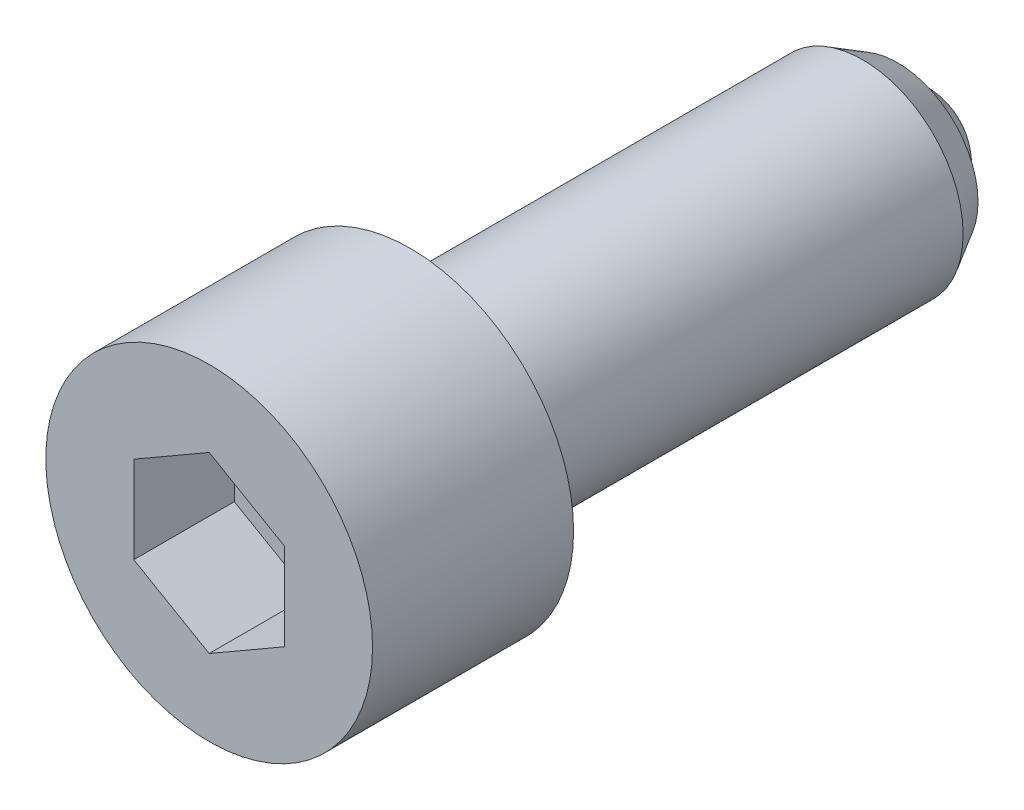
ISO-10303-21;
HEADER;
FILE_DESCRIPTION(('STEP AP214'),'2;1');
FILE_NAME('part.step','',(''),(''),'','','');
FILE_SCHEMA(('AUTOMOTIVE_DESIGN { 1 0 10303 214 1 1 1 1 }'));
ENDSEC;
DATA;
#1=APPLICATION_CONTEXT('core data for automotive mechanical design processes');
#2=APPLICATION_PROTOCOL_DEFINITION('international standard','automotive_design',2000,#1);
#3=PRODUCT_CONTEXT('',#1,'mechanical');
#4=PRODUCT('Part','Part','',(#3));
#5=PRODUCT_RELATED_PRODUCT_CATEGORY('part','',(#4));
#6=PRODUCT_DEFINITION_FORMATION('','',#4);
#7=PRODUCT_DEFINITION_CONTEXT('part definition',#1,'design');
#8=PRODUCT_DEFINITION('design','',#6,#7);
#9=PRODUCT_DEFINITION_SHAPE('','',#8);
#10=(LENGTH_UNIT() NAMED_UNIT(*) SI_UNIT(.MILLI.,.METRE.));
#11=(NAMED_UNIT(*) PLANE_ANGLE_UNIT() SI_UNIT($,.RADIAN.));
#12=(NAMED_UNIT(*) SI_UNIT($,.STERADIAN.) SOLID_ANGLE_UNIT());
#13=UNCERTAINTY_MEASURE_WITH_UNIT(LENGTH_MEASURE(1.E-05),#10,'distance_accuracy_value','');
#14=(GEOMETRIC_REPRESENTATION_CONTEXT(3) GLOBAL_UNCERTAINTY_ASSIGNED_CONTEXT((#13)) GLOBAL_UNIT_ASSIGNED_CONTEXT((#10,
#11,#12)) REPRESENTATION_CONTEXT('',''));
#15=CARTESIAN_POINT('',(0.,0.,0.));
#16=DIRECTION('',(0.,0.,1.));
#17=DIRECTION('',(1.,0.,0.));
#18=AXIS2_PLACEMENT_3D('',#15,#16,#17);
#19=CARTESIAN_POINT('',(-0.0954608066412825,0.,2.74834263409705));
#20=DIRECTION('',(0.,1.,0.));
#21=DIRECTION('',(1.,0.,0.));
#22=AXIS2_PLACEMENT_3D('',#19,#20,#21);
#23=CIRCLE('',#22,2.75);
#24=TRIMMED_CURVE('',#23,(PARAMETER_VALUE(-1.53607633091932)),
(PARAMETER_VALUE(1.53607633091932)),.T.,.PARAMETER.);
#25=CARTESIAN_POINT('',(0.,0.,2.74834263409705));
#26=DIRECTION('',(0.,0.,-1.));
#27=AXIS1_PLACEMENT('',#25,#26);
#28=SURFACE_OF_REVOLUTION('',#24,#27);
#29=CARTESIAN_POINT('',(0.,0.,1.9));
#30=DIRECTION('',(0.,0.,-1.));
#31=DIRECTION('',(1.,0.,0.));
#32=AXIS2_PLACEMENT_3D('',#29,#30,#31);
#33=CIRCLE('',#32,2.5204166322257);
#34=CARTESIAN_POINT('',(2.5204166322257,0.,1.9));
#35=VERTEX_POINT('',#34);
#36=EDGE_CURVE('E9',#35,#35,#33,.T.);
#37=ORIENTED_EDGE('',*,*,#36,.T.);
#38=EDGE_LOOP('',(#37));
#39=FACE_BOUND('',#38,.T.);
#40=CARTESIAN_POINT('',(0.,0.,0.));
#41=VERTEX_POINT('',#40);
#42=VERTEX_LOOP('',#41);
#43=FACE_BOUND('',#42,.T.);
#44=ADVANCED_FACE('F15',(#39,#43),#28,.T.);
#45=CARTESIAN_POINT('',(3.19170962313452,0.,1.9));
#46=DIRECTION('',(0.,0.,1.));
#47=DIRECTION('',(-1.,0.,0.));
#48=AXIS2_PLACEMENT_3D('',#45,#46,#47);
#49=PLANE('',#48);
#50=ORIENTED_EDGE('',*,*,#36,.F.);
#51=EDGE_LOOP('',(#50));
#52=FACE_BOUND('',#51,.T.);
#53=CARTESIAN_POINT('',(0.,0.,1.9));
#54=DIRECTION('',(0.,0.,-1.));
#55=DIRECTION('',(1.,0.,0.));
#56=AXIS2_PLACEMENT_3D('',#53,#54,#55);
#57=CIRCLE('',#56,3.19170962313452);
#58=CARTESIAN_POINT('',(3.19170962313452,0.,1.9));
#59=VERTEX_POINT('',#58);
#60=EDGE_CURVE('E22',#59,#59,#57,.T.);
#61=ORIENTED_EDGE('',*,*,#60,.T.);
#62=EDGE_LOOP('',(#61));
#63=FACE_BOUND('',#62,.T.);
#64=ADVANCED_FACE('F137',(#52,#63),#49,.F.);
#65=CARTESIAN_POINT('',(0.,0.,3.3));
#66=DIRECTION('',(0.,0.,1.));
#67=DIRECTION('',(-1.,0.,0.));
#68=AXIS2_PLACEMENT_3D('',#65,#66,#67);
#69=CONICAL_SURFACE('',#68,4.,0.523598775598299);
#70=ORIENTED_EDGE('',*,*,#60,.F.);
#71=EDGE_LOOP('',(#70));
#72=FACE_BOUND('',#71,.T.);
#73=CARTESIAN_POINT('',(0.,0.,3.3));
#74=DIRECTION('',(0.,0.,-1.));
#75=DIRECTION('',(1.,0.,0.));
#76=AXIS2_PLACEMENT_3D('',#73,#74,#75);
#77=CIRCLE('',#76,4.);
#78=CARTESIAN_POINT('',(4.,0.,3.3));
#79=VERTEX_POINT('',#78);
#80=EDGE_CURVE('E132',#79,#79,#77,.T.);
#81=ORIENTED_EDGE('',*,*,#80,.T.);
#82=EDGE_LOOP('',(#81));
#83=FACE_BOUND('',#82,.T.);
#84=ADVANCED_FACE('F139',(#72,#83),#69,.T.);
#85=CARTESIAN_POINT('',(0.,0.,1.3));
#86=DIRECTION('',(0.,0.,-1.));
#87=DIRECTION('',(1.,0.,0.));
#88=AXIS2_PLACEMENT_3D('',#85,#86,#87);
#89=CYLINDRICAL_SURFACE('',#88,4.);
#90=ORIENTED_EDGE('',*,*,#80,.F.);
#91=EDGE_LOOP('',(#90));
#92=FACE_BOUND('',#91,.T.);
#93=CARTESIAN_POINT('',(0.,0.,21.3));
#94=DIRECTION('',(0.,0.,-1.));
#95=DIRECTION('',(1.,0.,0.));
#96=AXIS2_PLACEMENT_3D('',#93,#94,#95);
#97=CIRCLE('',#96,4.);
#98=CARTESIAN_POINT('',(4.,0.,21.3));
#99=VERTEX_POINT('',#98);
#100=EDGE_CURVE('E129',#99,#99,#97,.T.);
#101=ORIENTED_EDGE('',*,*,#100,.T.);
#102=EDGE_LOOP('',(#101));
#103=FACE_BOUND('',#102,.T.);
#104=ADVANCED_FACE('F142',(#92,#103),#89,.T.);
#105=CARTESIAN_POINT('',(4.,0.,21.3));
#106=DIRECTION('',(0.,0.,-1.));
#107=DIRECTION('',(1.,0.,0.));
#108=AXIS2_PLACEMENT_3D('',#105,#106,#107);
#109=PLANE('',#108);
#110=CARTESIAN_POINT('',(0.,0.,21.3));
#111=DIRECTION('',(0.,0.,-1.));
#112=DIRECTION('',(1.,0.,0.));
#113=AXIS2_PLACEMENT_3D('',#110,#111,#112);
#114=CIRCLE('',#113,6.5);
#115=CARTESIAN_POINT('',(6.5,0.,21.3));
#116=VERTEX_POINT('',#115);
#117=EDGE_CURVE('E126',#116,#116,#114,.T.);
#118=ORIENTED_EDGE('',*,*,#117,.T.);
#119=EDGE_LOOP('',(#118));
#120=FACE_BOUND('',#119,.T.);
#121=ORIENTED_EDGE('',*,*,#100,.F.);
#122=EDGE_LOOP('',(#121));
#123=FACE_BOUND('',#122,.T.);
#124=ADVANCED_FACE('F148',(#120,#123),#109,.T.);
#125=CARTESIAN_POINT('',(0.,0.,1.3));
#126=DIRECTION('',(0.,0.,-1.));
#127=DIRECTION('',(1.,0.,0.));
#128=AXIS2_PLACEMENT_3D('',#125,#126,#127);
#129=CYLINDRICAL_SURFACE('',#128,6.5);
#130=CARTESIAN_POINT('',(0.,0.,29.3));
#131=DIRECTION('',(0.,0.,-1.));
#132=DIRECTION('',(1.,0.,0.));
#133=AXIS2_PLACEMENT_3D('',#130,#131,#132);
#134=CIRCLE('',#133,6.5);
#135=CARTESIAN_POINT('',(6.5,0.,29.3));
#136=VERTEX_POINT('',#135);
#137=EDGE_CURVE('E123',#136,#136,#134,.T.);
#138=ORIENTED_EDGE('',*,*,#137,.T.);
#139=EDGE_LOOP('',(#138));
#140=FACE_BOUND('',#139,.T.);
#141=ORIENTED_EDGE('',*,*,#117,.F.);
#142=EDGE_LOOP('',(#141));
#143=FACE_BOUND('',#142,.T.);
#144=ADVANCED_FACE('F153',(#140,#143),#129,.T.);
#145=CARTESIAN_POINT('',(6.5,0.,29.3));
#146=DIRECTION('',(0.,0.,1.));
#147=DIRECTION('',(-1.,0.,0.));
#148=AXIS2_PLACEMENT_3D('',#145,#146,#147);
#149=PLANE('',#148);
#150=DIRECTION('',(-0.86602540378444,0.5,0.));
#151=VECTOR('',#150,1.);
#152=CARTESIAN_POINT('',(3.,1.73205080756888,29.3));
#153=LINE('',#152,#151);
#154=CARTESIAN_POINT('',(3.,1.73205080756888,29.3));
#155=VERTEX_POINT('',#154);
#156=CARTESIAN_POINT('',(0.,3.46410161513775,29.3));
#157=VERTEX_POINT('',#156);
#158=EDGE_CURVE('E29',#155,#157,#153,.T.);
#159=ORIENTED_EDGE('',*,*,#158,.F.);
#160=DIRECTION('',(0.,1.,0.));
#161=VECTOR('',#160,1.);
#162=CARTESIAN_POINT('',(3.,-1.73205080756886,29.3));
#163=LINE('',#162,#161);
#164=CARTESIAN_POINT('',(3.,-1.73205080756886,29.3));
#165=VERTEX_POINT('',#164);
#166=EDGE_CURVE('E97',#165,#155,#163,.T.);
#167=ORIENTED_EDGE('',*,*,#166,.F.);
#168=DIRECTION('',(-0.866025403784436,-0.5,0.));
#169=VECTOR('',#168,1.);
#170=CARTESIAN_POINT('',(3.,-1.73205080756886,29.3));
#171=LINE('',#170,#169);
#172=CARTESIAN_POINT('',(0.,-3.46410161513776,29.3));
#173=VERTEX_POINT('',#172);
#174=EDGE_CURVE('E92',#165,#173,#171,.T.);
#175=ORIENTED_EDGE('',*,*,#174,.T.);
#176=DIRECTION('',(0.866025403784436,-0.5,0.));
#177=VECTOR('',#176,1.);
#178=CARTESIAN_POINT('',(-3.,-1.73205080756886,29.3));
#179=LINE('',#178,#177);
#180=CARTESIAN_POINT('',(-3.,-1.73205080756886,29.3));
#181=VERTEX_POINT('',#180);
#182=EDGE_CURVE('E90',#181,#173,#179,.T.);
#183=ORIENTED_EDGE('',*,*,#182,.F.);
#184=DIRECTION('',(0.,1.,0.));
#185=VECTOR('',#184,1.);
#186=CARTESIAN_POINT('',(-3.,-1.73205080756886,29.3));
#187=LINE('',#186,#185);
#188=CARTESIAN_POINT('',(-3.,1.73205080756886,29.3));
#189=VERTEX_POINT('',#188);
#190=EDGE_CURVE('E71',#181,#189,#187,.T.);
#191=ORIENTED_EDGE('',*,*,#190,.T.);
#192=DIRECTION('',(0.866025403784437,0.5,0.));
#193=VECTOR('',#192,1.);
#194=CARTESIAN_POINT('',(-3.,1.73205080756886,29.3));
#195=LINE('',#194,#193);
#196=EDGE_CURVE('E82',#189,#157,#195,.T.);
#197=ORIENTED_EDGE('',*,*,#196,.T.);
#198=EDGE_LOOP('',(#159,#167,#175,#183,#191,#197));
#199=FACE_BOUND('',#198,.T.);
#200=ORIENTED_EDGE('',*,*,#137,.F.);
#201=EDGE_LOOP('',(#200));
#202=FACE_BOUND('',#201,.T.);
#203=ADVANCED_FACE('F86',(#199,#202),#149,.T.);
#204=CARTESIAN_POINT('',(3.,1.73205080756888,25.3));
#205=DIRECTION('',(0.5,0.86602540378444,0.));
#206=DIRECTION('',(0.86602540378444,-0.5,0.));
#207=AXIS2_PLACEMENT_3D('',#204,#205,#206);
#208=PLANE('',#207);
#209=DIRECTION('',(0.,0.,1.));
#210=VECTOR('',#209,1.);
#211=CARTESIAN_POINT('',(3.,1.73205080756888,25.3));
#212=LINE('',#211,#210);
#213=CARTESIAN_POINT('',(3.,1.73205080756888,25.3));
#214=VERTEX_POINT('',#213);
#215=EDGE_CURVE('E121',#214,#155,#212,.T.);
#216=ORIENTED_EDGE('',*,*,#215,.T.);
#217=ORIENTED_EDGE('',*,*,#158,.T.);
#218=DIRECTION('',(0.,0.,1.));
#219=VECTOR('',#218,1.);
#220=CARTESIAN_POINT('',(0.,3.46410161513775,25.3));
#221=LINE('',#220,#219);
#222=CARTESIAN_POINT('',(0.,3.46410161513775,25.3));
#223=VERTEX_POINT('',#222);
#224=EDGE_CURVE('E79',#223,#157,#221,.T.);
#225=ORIENTED_EDGE('',*,*,#224,.F.);
#226=DIRECTION('',(-0.86602540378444,0.5,0.));
#227=VECTOR('',#226,1.);
#228=CARTESIAN_POINT('',(3.,1.73205080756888,25.3));
#229=LINE('',#228,#227);
#230=EDGE_CURVE('E100',#214,#223,#229,.T.);
#231=ORIENTED_EDGE('',*,*,#230,.F.);
#232=EDGE_LOOP('',(#216,#217,#225,#231));
#233=FACE_BOUND('',#232,.T.);
#234=ADVANCED_FACE('F207',(#233),#208,.F.);
#235=CARTESIAN_POINT('',(3.,-1.73205080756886,25.3));
#236=DIRECTION('',(1.,0.,0.));
#237=DIRECTION('',(0.,-1.,0.));
#238=AXIS2_PLACEMENT_3D('',#235,#236,#237);
#239=PLANE('',#238);
#240=DIRECTION('',(0.,0.,1.));
#241=VECTOR('',#240,1.);
#242=CARTESIAN_POINT('',(3.,-1.73205080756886,25.3));
#243=LINE('',#242,#241);
#244=CARTESIAN_POINT('',(3.,-1.73205080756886,25.3));
#245=VERTEX_POINT('',#244);
#246=EDGE_CURVE('E119',#245,#165,#243,.T.);
#247=ORIENTED_EDGE('',*,*,#246,.T.);
#248=ORIENTED_EDGE('',*,*,#166,.T.);
#249=ORIENTED_EDGE('',*,*,#215,.F.);
#250=DIRECTION('',(0.,1.,0.));
#251=VECTOR('',#250,1.);
#252=CARTESIAN_POINT('',(3.,-1.73205080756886,25.3));
#253=LINE('',#252,#251);
#254=EDGE_CURVE('E112',#245,#214,#253,.T.);
#255=ORIENTED_EDGE('',*,*,#254,.F.);
#256=EDGE_LOOP('',(#247,#248,#249,#255));
#257=FACE_BOUND('',#256,.T.);
#258=ADVANCED_FACE('F216',(#257),#239,.F.);
#259=CARTESIAN_POINT('',(3.,-1.73205080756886,25.3));
#260=DIRECTION('',(-0.5,0.866025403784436,0.));
#261=DIRECTION('',(0.866025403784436,0.5,0.));
#262=AXIS2_PLACEMENT_3D('',#259,#260,#261);
#263=PLANE('',#262);
#264=DIRECTION('',(0.,0.,1.));
#265=VECTOR('',#264,1.);
#266=CARTESIAN_POINT('',(0.,-3.46410161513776,25.3));
#267=LINE('',#266,#265);
#268=CARTESIAN_POINT('',(0.,-3.46410161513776,25.3));
#269=VERTEX_POINT('',#268);
#270=EDGE_CURVE('E117',#269,#173,#267,.T.);
#271=ORIENTED_EDGE('',*,*,#270,.T.);
#272=ORIENTED_EDGE('',*,*,#174,.F.);
#273=ORIENTED_EDGE('',*,*,#246,.F.);
#274=DIRECTION('',(-0.866025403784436,-0.5,0.));
#275=VECTOR('',#274,1.);
#276=CARTESIAN_POINT('',(3.,-1.73205080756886,25.3));
#277=LINE('',#276,#275);
#278=EDGE_CURVE('E109',#245,#269,#277,.T.);
#279=ORIENTED_EDGE('',*,*,#278,.T.);
#280=EDGE_LOOP('',(#271,#272,#273,#279));
#281=FACE_BOUND('',#280,.T.);
#282=ADVANCED_FACE('F225',(#281),#263,.T.);
#283=CARTESIAN_POINT('',(-3.,-1.73205080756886,25.3));
#284=DIRECTION('',(-0.5,-0.866025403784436,0.));
#285=DIRECTION('',(-0.866025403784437,0.5,0.));
#286=AXIS2_PLACEMENT_3D('',#283,#284,#285);
#287=PLANE('',#286);
#288=DIRECTION('',(0.,0.,1.));
#289=VECTOR('',#288,1.);
#290=CARTESIAN_POINT('',(-3.,-1.73205080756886,25.3));
#291=LINE('',#290,#289);
#292=CARTESIAN_POINT('',(-3.,-1.73205080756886,25.3));
#293=VERTEX_POINT('',#292);
#294=EDGE_CURVE('E78',#293,#181,#291,.T.);
#295=ORIENTED_EDGE('',*,*,#294,.T.);
#296=ORIENTED_EDGE('',*,*,#182,.T.);
#297=ORIENTED_EDGE('',*,*,#270,.F.);
#298=DIRECTION('',(0.866025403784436,-0.5,0.));
#299=VECTOR('',#298,1.);
#300=CARTESIAN_POINT('',(-3.,-1.73205080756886,25.3));
#301=LINE('',#300,#299);
#302=EDGE_CURVE('E106',#293,#269,#301,.T.);
#303=ORIENTED_EDGE('',*,*,#302,.F.);
#304=EDGE_LOOP('',(#295,#296,#297,#303));
#305=FACE_BOUND('',#304,.T.);
#306=ADVANCED_FACE('F235',(#305),#287,.F.);
#307=CARTESIAN_POINT('',(-3.,-1.73205080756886,25.3));
#308=DIRECTION('',(1.,0.,0.));
#309=DIRECTION('',(0.,-1.,0.));
#310=AXIS2_PLACEMENT_3D('',#307,#308,#309);
#311=PLANE('',#310);
#312=DIRECTION('',(0.,0.,1.));
#313=VECTOR('',#312,1.);
#314=CARTESIAN_POINT('',(-3.,1.73205080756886,25.3));
#315=LINE('',#314,#313);
#316=CARTESIAN_POINT('',(-3.,1.73205080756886,25.3));
#317=VERTEX_POINT('',#316);
#318=EDGE_CURVE('E67',#317,#189,#315,.T.);
#319=ORIENTED_EDGE('',*,*,#318,.T.);
#320=ORIENTED_EDGE('',*,*,#190,.F.);
#321=ORIENTED_EDGE('',*,*,#294,.F.);
#322=DIRECTION('',(0.,1.,0.));
#323=VECTOR('',#322,1.);
#324=CARTESIAN_POINT('',(-3.,-1.73205080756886,25.3));
#325=LINE('',#324,#323);
#326=EDGE_CURVE('E74',#293,#317,#325,.T.);
#327=ORIENTED_EDGE('',*,*,#326,.T.);
#328=EDGE_LOOP('',(#319,#320,#321,#327));
#329=FACE_BOUND('',#328,.T.);
#330=ADVANCED_FACE('F69',(#329),#311,.T.);
#331=CARTESIAN_POINT('',(-3.,1.73205080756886,25.3));
#332=DIRECTION('',(0.5,-0.866025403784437,0.));
#333=DIRECTION('',(-0.866025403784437,-0.5,0.));
#334=AXIS2_PLACEMENT_3D('',#331,#332,#333);
#335=PLANE('',#334);
#336=DIRECTION('',(0.866025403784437,0.5,0.));
#337=VECTOR('',#336,1.);
#338=CARTESIAN_POINT('',(-3.,1.73205080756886,25.3));
#339=LINE('',#338,#337);
#340=EDGE_CURVE('E103',#317,#223,#339,.T.);
#341=ORIENTED_EDGE('',*,*,#340,.T.);
#342=ORIENTED_EDGE('',*,*,#224,.T.);
#343=ORIENTED_EDGE('',*,*,#196,.F.);
#344=ORIENTED_EDGE('',*,*,#318,.F.);
#345=EDGE_LOOP('',(#341,#342,#343,#344));
#346=FACE_BOUND('',#345,.T.);
#347=ADVANCED_FACE('F83',(#346),#335,.T.);
#348=CARTESIAN_POINT('',(6.,0.,25.3));
#349=DIRECTION('',(0.,0.,1.));
#350=DIRECTION('',(-1.,0.,0.));
#351=AXIS2_PLACEMENT_3D('',#348,#349,#350);
#352=PLANE('',#351);
#353=ORIENTED_EDGE('',*,*,#230,.T.);
#354=ORIENTED_EDGE('',*,*,#340,.F.);
#355=ORIENTED_EDGE('',*,*,#326,.F.);
#356=ORIENTED_EDGE('',*,*,#302,.T.);
#357=ORIENTED_EDGE('',*,*,#278,.F.);
#358=ORIENTED_EDGE('',*,*,#254,.T.);
#359=EDGE_LOOP('',(#353,#354,#355,#356,#357,#358));
#360=FACE_BOUND('',#359,.T.);
#361=ADVANCED_FACE('F255',(#360),#352,.T.);
#362=CLOSED_SHELL('',(#44,#64,#84,#104,#124,#144,#203,#234,#258,#282,#306,#330,#347,#361));
#363=MANIFOLD_SOLID_BREP('B1',#362);
#364=ADVANCED_BREP_SHAPE_REPRESENTATION('',(#18,#363),#14);
#365=SHAPE_DEFINITION_REPRESENTATION(#9,#364);
ENDSEC;
END-ISO-10303-21;
